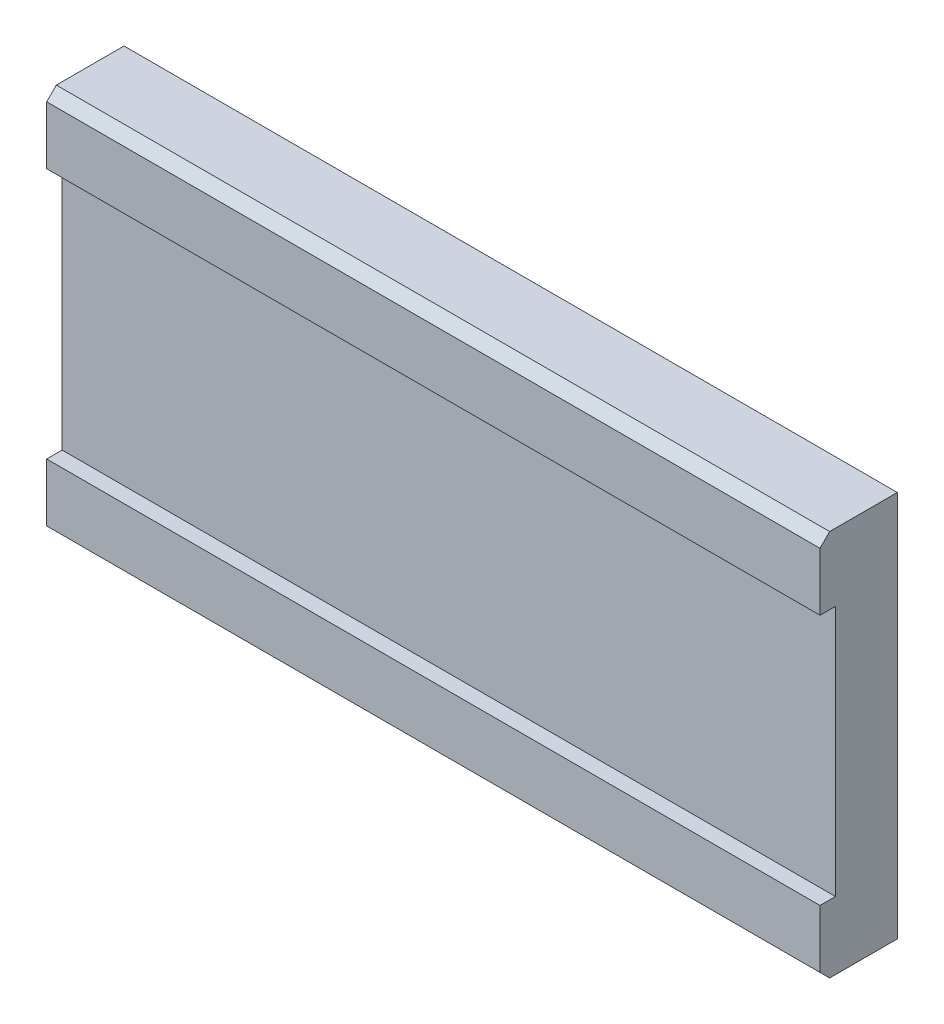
from build123d import *

# Parameters (mm, degrees)
SKIZZE1_W               = 200
SKIZZE1_H               = 100
LINEAR_AUSTRAGEN1_DEPTH = 20
SKIZZE2_W               = 200
SKIZZE2_H               = 65
LINEAR_AUSTRAGEN2_DEPTH = 4
FASE1_SIZE              = 2.5


with BuildPart() as part:
    # Skizze1 → Linear austragen1 (new body)
    with BuildSketch(Plane.XY):
        with Locations((100, 50)):
            Rectangle(SKIZZE1_W, SKIZZE1_H)
    extrude(amount=LINEAR_AUSTRAGEN1_DEPTH)

    # Skizze2 → Linear austragen2 (cut)
    with BuildSketch(Plane.XY.offset(20)):
        with Locations((100, 50)):
            Rectangle(SKIZZE2_W, SKIZZE2_H)
    extrude(amount=-LINEAR_AUSTRAGEN2_DEPTH, mode=Mode.SUBTRACT)

    # Fase1
    fase1_edges = [part.edges().sort_by_distance(p)[0] for p in [
        (100, 100, 20),
        (100, 0, 20),
    ]]
    chamfer(fase1_edges, length=FASE1_SIZE)


solid = part.part
